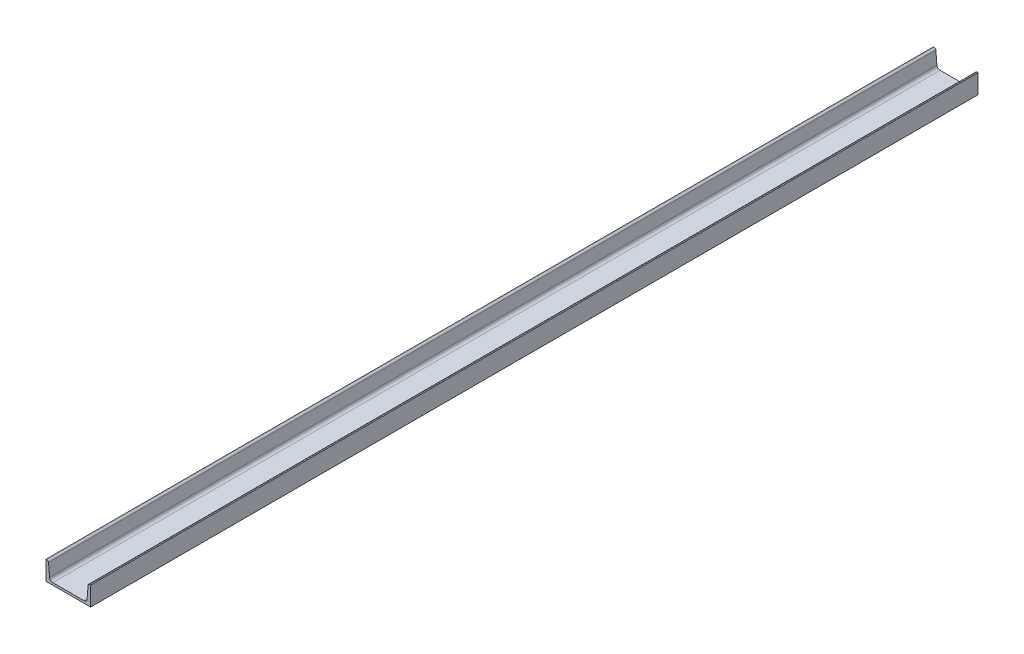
from build123d import *

# Parameters (mm, degrees)
BOSS_EXTRU_1_DEPTH = 2783


with BuildPart() as part:
    # Esquisse1 → Boss.-Extru.1 (new body)
    with BuildSketch(Plane.XY.offset(1391.5)):
        with BuildLine():
            Line((48.928051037, 7), (-48.928051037, 7))
            ThreePointArc((-48.928051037, 7), (-55.711320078, 9.652397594), (-58.896203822, 16.202547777))
            Line((-58.896203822, 16.202547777), (-62.031898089, 55.398726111))
            ThreePointArc((-62.031898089, 55.398726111), (-63.624339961, 58.673801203), (-67.015974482, 60))
            Line((-67.015974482, 60), (-70, 60))
            Line((-70, 60), (-70, 0))
            Line((-70, 0), (70, 0))
            Line((70, 0), (70, 60))
            Line((70, 60), (67.015974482, 60))
            ThreePointArc((67.015974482, 60), (63.624339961, 58.673801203), (62.031898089, 55.398726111))
            Line((62.031898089, 55.398726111), (58.896203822, 16.202547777))
            ThreePointArc((58.896203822, 16.202547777), (55.711320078, 9.652397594), (48.928051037, 7))
        make_face()
    extrude(amount=-BOSS_EXTRU_1_DEPTH)


solid = part.part
